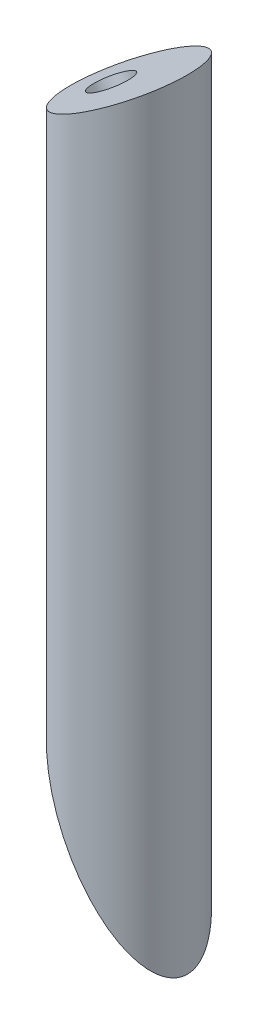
from build123d import *

# Parameters (mm, degrees)
SKETCH3_R           = 7.5
BOSS_EXTRUDE1_DEPTH = 100
CUT_EXTRUDE1_DEPTH  = 50
SKETCH6_R           = 2.5
CUT_EXTRUDE2_DEPTH  = 10
SKETCH7_R           = 2.5
CUT_EXTRUDE3_DEPTH  = 10


with BuildPart() as part:
    # Sketch3 → Boss-Extrude1 (new body)
    with BuildSketch(Plane(origin=(0, 0, 0), x_dir=(1, 0, 0), z_dir=(0, 1, 0))):
        with Locations(Location((0, 0, 0), (0, 0, 270))):
            Circle(SKETCH3_R)
    extrude(amount=BOSS_EXTRUDE1_DEPTH)

    # Sketch5 → Cut-Extrude1 (cut, symmetric)
    with BuildSketch(Plane.XY):
        Polygon((7.5, 100), (-7.5, 100), (-7.5, 91.339745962), align=None)
        Polygon((-7.5, 25.980762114), (-7.5, 0), (7.5, 0), align=None)
    extrude(amount=CUT_EXTRUDE1_DEPTH, both=True, mode=Mode.SUBTRACT)

    # Sketch6 → Cut-Extrude2 (cut)
    with BuildSketch(Plane(origin=(-41.426270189, 71.752404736, 0), x_dir=(0.8660254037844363, 0.5000000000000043, 0), z_dir=(-0.5000000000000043, 0.8660254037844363, 0))):
        with Locations(Location((45.174682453, 0, 0), (0, 0, 180))):
            Circle(SKETCH6_R)
    extrude(amount=-CUT_EXTRUDE2_DEPTH, mode=Mode.SUBTRACT)

    # Sketch7 → Cut-Extrude3 (cut)
    with BuildSketch(Plane(origin=(5.625, 3.247595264, 0), x_dir=(0, 0, 1), z_dir=(-0.8660254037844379, -0.5000000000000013, 0))):
        with Locations(Location((0, 18.25, 0), (0, 0, 270))):
            Circle(SKETCH7_R)
    extrude(amount=-CUT_EXTRUDE3_DEPTH, mode=Mode.SUBTRACT)


solid = part.part
